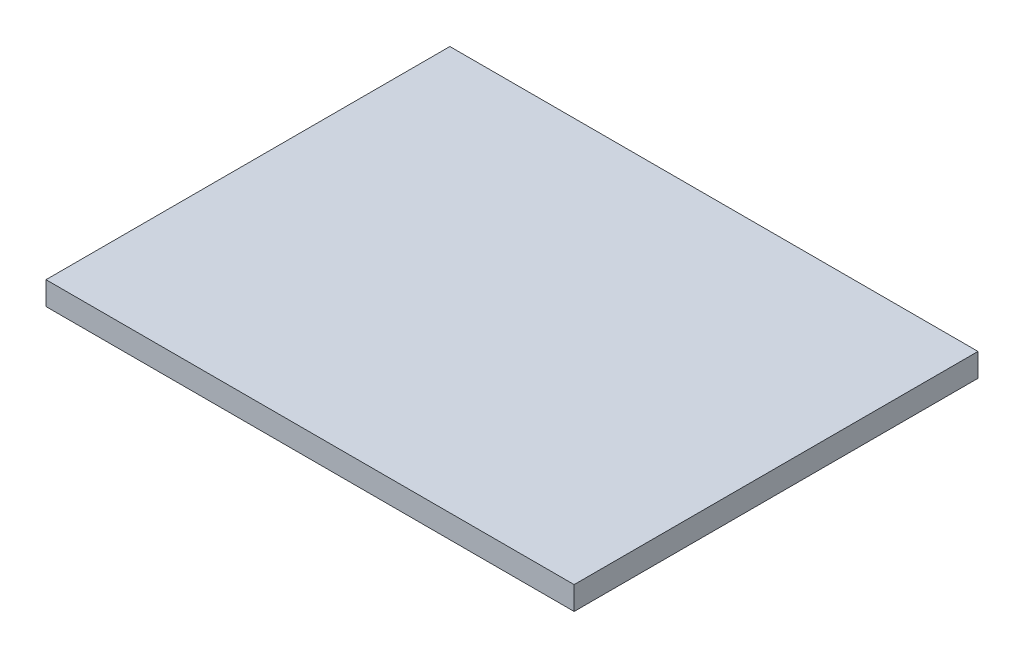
ISO-10303-21;
HEADER;
FILE_DESCRIPTION(('STEP AP214'),'2;1');
FILE_NAME('part.step','',(''),(''),'','','');
FILE_SCHEMA(('AUTOMOTIVE_DESIGN { 1 0 10303 214 1 1 1 1 }'));
ENDSEC;
DATA;
#1=APPLICATION_CONTEXT('core data for automotive mechanical design processes');
#2=APPLICATION_PROTOCOL_DEFINITION('international standard','automotive_design',2000,#1);
#3=PRODUCT_CONTEXT('',#1,'mechanical');
#4=PRODUCT('Part','Part','',(#3));
#5=PRODUCT_RELATED_PRODUCT_CATEGORY('part','',(#4));
#6=PRODUCT_DEFINITION_FORMATION('','',#4);
#7=PRODUCT_DEFINITION_CONTEXT('part definition',#1,'design');
#8=PRODUCT_DEFINITION('design','',#6,#7);
#9=PRODUCT_DEFINITION_SHAPE('','',#8);
#10=(LENGTH_UNIT() NAMED_UNIT(*) SI_UNIT(.MILLI.,.METRE.));
#11=(NAMED_UNIT(*) PLANE_ANGLE_UNIT() SI_UNIT($,.RADIAN.));
#12=(NAMED_UNIT(*) SI_UNIT($,.STERADIAN.) SOLID_ANGLE_UNIT());
#13=UNCERTAINTY_MEASURE_WITH_UNIT(LENGTH_MEASURE(1.E-05),#10,'distance_accuracy_value','');
#14=(GEOMETRIC_REPRESENTATION_CONTEXT(3) GLOBAL_UNCERTAINTY_ASSIGNED_CONTEXT((#13)) GLOBAL_UNIT_ASSIGNED_CONTEXT((#10,
#11,#12)) REPRESENTATION_CONTEXT('',''));
#15=CARTESIAN_POINT('',(0.,0.,0.));
#16=DIRECTION('',(0.,0.,1.));
#17=DIRECTION('',(1.,0.,0.));
#18=AXIS2_PLACEMENT_3D('',#15,#16,#17);
#19=CARTESIAN_POINT('',(53.975,4.7625,41.275));
#20=DIRECTION('',(-1.,0.,0.));
#21=DIRECTION('',(0.,0.,1.));
#22=AXIS2_PLACEMENT_3D('',#19,#20,#21);
#23=PLANE('',#22);
#24=DIRECTION('',(0.,0.,-1.));
#25=VECTOR('',#24,1.);
#26=CARTESIAN_POINT('',(53.975,0.,41.275));
#27=LINE('',#26,#25);
#28=CARTESIAN_POINT('',(53.975,0.,41.275));
#29=VERTEX_POINT('',#28);
#30=CARTESIAN_POINT('',(53.975,0.,-41.275));
#31=VERTEX_POINT('',#30);
#32=EDGE_CURVE('E111',#29,#31,#27,.T.);
#33=ORIENTED_EDGE('',*,*,#32,.T.);
#34=DIRECTION('',(0.,-1.,0.));
#35=VECTOR('',#34,1.);
#36=CARTESIAN_POINT('',(53.975,4.7625,-41.275));
#37=LINE('',#36,#35);
#38=CARTESIAN_POINT('',(53.975,4.7625,-41.275));
#39=VERTEX_POINT('',#38);
#40=EDGE_CURVE('E11',#39,#31,#37,.T.);
#41=ORIENTED_EDGE('',*,*,#40,.F.);
#42=DIRECTION('',(0.,0.,-1.));
#43=VECTOR('',#42,1.);
#44=CARTESIAN_POINT('',(53.975,4.7625,41.275));
#45=LINE('',#44,#43);
#46=CARTESIAN_POINT('',(53.975,4.7625,41.275));
#47=VERTEX_POINT('',#46);
#48=EDGE_CURVE('E95',#47,#39,#45,.T.);
#49=ORIENTED_EDGE('',*,*,#48,.F.);
#50=DIRECTION('',(0.,-1.,0.));
#51=VECTOR('',#50,1.);
#52=CARTESIAN_POINT('',(53.975,4.7625,41.275));
#53=LINE('',#52,#51);
#54=EDGE_CURVE('E107',#47,#29,#53,.T.);
#55=ORIENTED_EDGE('',*,*,#54,.T.);
#56=EDGE_LOOP('',(#33,#41,#49,#55));
#57=FACE_BOUND('',#56,.T.);
#58=ADVANCED_FACE('F43',(#57),#23,.F.);
#59=CARTESIAN_POINT('',(-53.975,4.7625,-41.275));
#60=DIRECTION('',(0.,0.,1.));
#61=DIRECTION('',(1.,0.,0.));
#62=AXIS2_PLACEMENT_3D('',#59,#60,#61);
#63=PLANE('',#62);
#64=DIRECTION('',(-1.,0.,0.));
#65=VECTOR('',#64,1.);
#66=CARTESIAN_POINT('',(-53.975,0.,-41.275));
#67=LINE('',#66,#65);
#68=CARTESIAN_POINT('',(-53.975,0.,-41.275));
#69=VERTEX_POINT('',#68);
#70=EDGE_CURVE('E100',#31,#69,#67,.T.);
#71=ORIENTED_EDGE('',*,*,#70,.T.);
#72=DIRECTION('',(0.,-1.,0.));
#73=VECTOR('',#72,1.);
#74=CARTESIAN_POINT('',(-53.975,4.7625,-41.275));
#75=LINE('',#74,#73);
#76=CARTESIAN_POINT('',(-53.975,4.7625,-41.275));
#77=VERTEX_POINT('',#76);
#78=EDGE_CURVE('E52',#77,#69,#75,.T.);
#79=ORIENTED_EDGE('',*,*,#78,.F.);
#80=DIRECTION('',(-1.,0.,0.));
#81=VECTOR('',#80,1.);
#82=CARTESIAN_POINT('',(-53.975,4.7625,-41.275));
#83=LINE('',#82,#81);
#84=EDGE_CURVE('E90',#39,#77,#83,.T.);
#85=ORIENTED_EDGE('',*,*,#84,.F.);
#86=ORIENTED_EDGE('',*,*,#40,.T.);
#87=EDGE_LOOP('',(#71,#79,#85,#86));
#88=FACE_BOUND('',#87,.T.);
#89=ADVANCED_FACE('F99',(#88),#63,.F.);
#90=CARTESIAN_POINT('',(-53.975,4.7625,41.275));
#91=DIRECTION('',(1.,0.,0.));
#92=DIRECTION('',(0.,0.,-1.));
#93=AXIS2_PLACEMENT_3D('',#90,#91,#92);
#94=PLANE('',#93);
#95=DIRECTION('',(0.,0.,1.));
#96=VECTOR('',#95,1.);
#97=CARTESIAN_POINT('',(-53.975,0.,41.275));
#98=LINE('',#97,#96);
#99=CARTESIAN_POINT('',(-53.975,0.,41.275));
#100=VERTEX_POINT('',#99);
#101=EDGE_CURVE('E77',#69,#100,#98,.T.);
#102=ORIENTED_EDGE('',*,*,#101,.T.);
#103=DIRECTION('',(0.,-1.,0.));
#104=VECTOR('',#103,1.);
#105=CARTESIAN_POINT('',(-53.975,4.7625,41.275));
#106=LINE('',#105,#104);
#107=CARTESIAN_POINT('',(-53.975,4.7625,41.275));
#108=VERTEX_POINT('',#107);
#109=EDGE_CURVE('E102',#108,#100,#106,.T.);
#110=ORIENTED_EDGE('',*,*,#109,.F.);
#111=DIRECTION('',(0.,0.,1.));
#112=VECTOR('',#111,1.);
#113=CARTESIAN_POINT('',(-53.975,4.7625,41.275));
#114=LINE('',#113,#112);
#115=EDGE_CURVE('E93',#77,#108,#114,.T.);
#116=ORIENTED_EDGE('',*,*,#115,.F.);
#117=ORIENTED_EDGE('',*,*,#78,.T.);
#118=EDGE_LOOP('',(#102,#110,#116,#117));
#119=FACE_BOUND('',#118,.T.);
#120=ADVANCED_FACE('F103',(#119),#94,.F.);
#121=CARTESIAN_POINT('',(-53.975,4.7625,41.275));
#122=DIRECTION('',(0.,0.,-1.));
#123=DIRECTION('',(-1.,0.,0.));
#124=AXIS2_PLACEMENT_3D('',#121,#122,#123);
#125=PLANE('',#124);
#126=DIRECTION('',(1.,0.,0.));
#127=VECTOR('',#126,1.);
#128=CARTESIAN_POINT('',(-53.975,0.,41.275));
#129=LINE('',#128,#127);
#130=EDGE_CURVE('E83',#100,#29,#129,.T.);
#131=ORIENTED_EDGE('',*,*,#130,.T.);
#132=ORIENTED_EDGE('',*,*,#54,.F.);
#133=DIRECTION('',(1.,0.,0.));
#134=VECTOR('',#133,1.);
#135=CARTESIAN_POINT('',(-53.975,4.7625,41.275));
#136=LINE('',#135,#134);
#137=EDGE_CURVE('E60',#108,#47,#136,.T.);
#138=ORIENTED_EDGE('',*,*,#137,.F.);
#139=ORIENTED_EDGE('',*,*,#109,.T.);
#140=EDGE_LOOP('',(#131,#132,#138,#139));
#141=FACE_BOUND('',#140,.T.);
#142=ADVANCED_FACE('F124',(#141),#125,.F.);
#143=CARTESIAN_POINT('',(0.,4.7625,0.));
#144=DIRECTION('',(0.,-1.,0.));
#145=DIRECTION('',(0.,0.,-1.));
#146=AXIS2_PLACEMENT_3D('',#143,#144,#145);
#147=PLANE('',#146);
#148=ORIENTED_EDGE('',*,*,#48,.T.);
#149=ORIENTED_EDGE('',*,*,#84,.T.);
#150=ORIENTED_EDGE('',*,*,#115,.T.);
#151=ORIENTED_EDGE('',*,*,#137,.T.);
#152=EDGE_LOOP('',(#148,#149,#150,#151));
#153=FACE_BOUND('',#152,.T.);
#154=ADVANCED_FACE('F91',(#153),#147,.F.);
#155=CARTESIAN_POINT('',(0.,0.,0.));
#156=DIRECTION('',(0.,-1.,0.));
#157=DIRECTION('',(0.,0.,-1.));
#158=AXIS2_PLACEMENT_3D('',#155,#156,#157);
#159=PLANE('',#158);
#160=ORIENTED_EDGE('',*,*,#32,.F.);
#161=ORIENTED_EDGE('',*,*,#130,.F.);
#162=ORIENTED_EDGE('',*,*,#101,.F.);
#163=ORIENTED_EDGE('',*,*,#70,.F.);
#164=EDGE_LOOP('',(#160,#161,#162,#163));
#165=FACE_BOUND('',#164,.T.);
#166=ADVANCED_FACE('F127',(#165),#159,.T.);
#167=CLOSED_SHELL('',(#58,#89,#120,#142,#154,#166));
#168=MANIFOLD_SOLID_BREP('B2',#167);
#169=ADVANCED_BREP_SHAPE_REPRESENTATION('',(#18,#168),#14);
#170=SHAPE_DEFINITION_REPRESENTATION(#9,#169);
ENDSEC;
END-ISO-10303-21;
